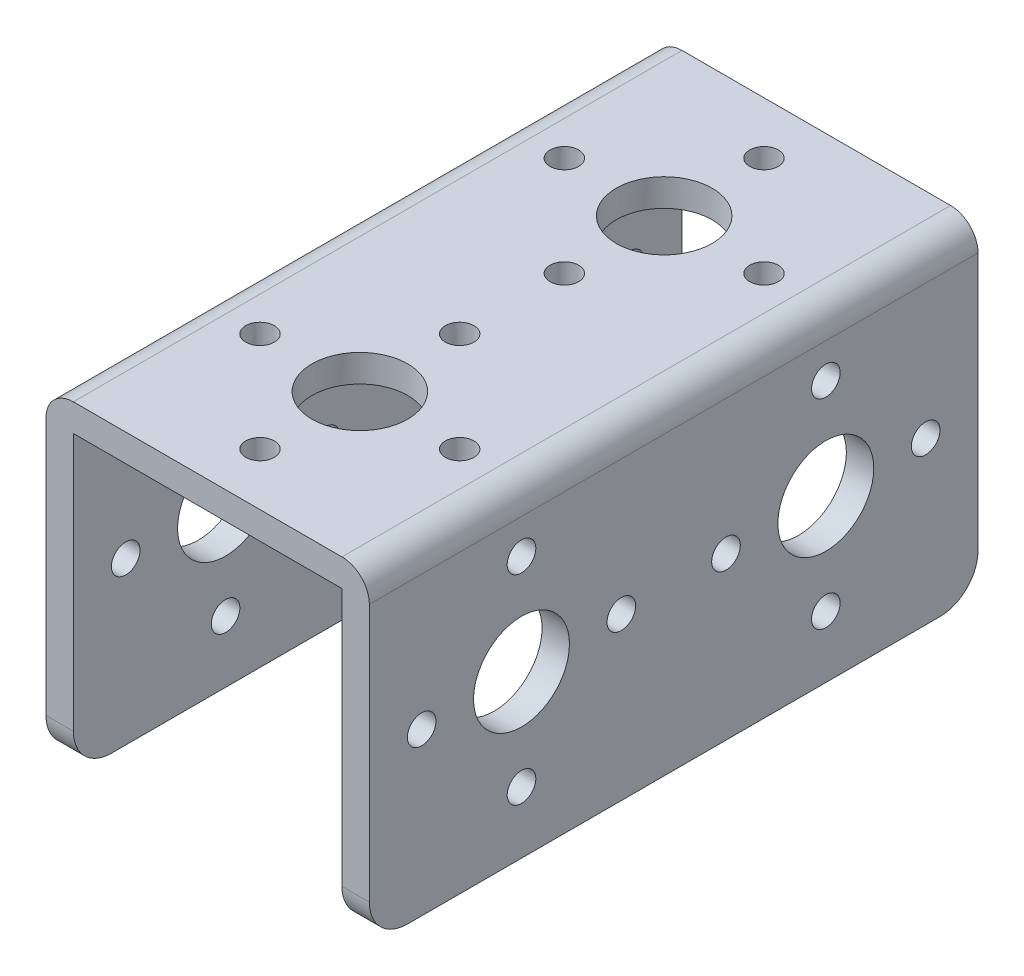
from build123d import *

# Parameters (mm, degrees)
EXTRUDE1_DEPTH      = 50.8
SKETCH2_R           = 4.0005
SKETCH2_R_2         = 1.1938
CUT_EXTRUDE1_DEPTH  = 47.312717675
SKETCH22_R          = 4.0005
SKETCH22_R_2        = 1.1938
CUT_EXTRUDE12_DEPTH = 48.801084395
LPATTERN1_COUNT     = 2
LPATTERN1_PITCH     = 25.4
FILLET1_R           = 2.286
FILLET2_R           = 3.175


with BuildPart() as part:
    # Sketch1 → Extrude1 (new body)
    with BuildSketch(Plane.XY):
        Polygon((11.20775, -26.9875), (11.20775, -2.286), (-11.20775, -2.286), (-11.20775, -26.9875), (-13.49375, -26.9875), (-13.49375, 0), (13.49375, 0), (13.49375, -26.9875), align=None)
    extrude(amount=-EXTRUDE1_DEPTH)

    # Sketch2 → Cut-Extrude1 (cut, through all)
    with BuildSketch(Plane(origin=(13.49375, -15.292465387, -16.409839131), x_dir=(0, 0, -1), z_dir=(1, 0, 0))):
        with Locations((-3.709839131, 1.792365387)):
            Circle(SKETCH2_R)
        with Locations((-3.709839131, 10.123565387)):
            Circle(SKETCH2_R_2)
        with Locations((4.621360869, 1.792365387)):
            Circle(SKETCH2_R_2)
        with Locations((-3.709839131, -6.538834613)):
            Circle(SKETCH2_R_2)
        with Locations((-12.041039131, 1.792365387)):
            Circle(SKETCH2_R_2)
    cut_extrude1 = extrude(amount=-CUT_EXTRUDE1_DEPTH, mode=Mode.SUBTRACT)

    # Sketch22 → Cut-Extrude12 (cut, through all)
    with BuildSketch(Plane(origin=(-3.640346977, 0, -15.26070859), x_dir=(-1, 0, 0), z_dir=(0, 1, 0))):
        with Locations(Location((-3.640346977, 2.56070859, 0), (0, 0, 90))):
            Circle(SKETCH22_R)
        with Locations(Location((-3.640346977, 10.89190859, 0), (0, 0, 90))):
            Circle(SKETCH22_R_2)
        with Locations(Location((4.690853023, 2.56070859, 0), (0, 0, 90))):
            Circle(SKETCH22_R_2)
        with Locations(Location((-3.640346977, -5.77049141, 0), (0, 0, 90))):
            Circle(SKETCH22_R_2)
        with Locations(Location((-11.971546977, 2.56070859, 0), (0, 0, 90))):
            Circle(SKETCH22_R_2)
    cut_extrude12 = extrude(amount=-CUT_EXTRUDE12_DEPTH, mode=Mode.SUBTRACT)

    # LPattern1: Cut-Extrude1, Cut-Extrude12 ×2
    with Locations(*[(0, 0, -i * LPATTERN1_PITCH) for i in range(1, LPATTERN1_COUNT)]):
        add(cut_extrude1, mode=Mode.SUBTRACT)
        add(cut_extrude12, mode=Mode.SUBTRACT)

    # Fillet1
    fillet1_edges = [part.edges().sort_by_distance(p)[0] for p in [
        (-13.49375, 0, -25.4),
        (13.49375, 0, -25.4),
    ]]
    fillet(fillet1_edges, radius=FILLET1_R)

    # Fillet2
    fillet2_edges = [part.edges().sort_by_distance(p)[0] for p in [
        (12.35075, -26.9875, -50.8),
        (-12.35075, -26.9875, -50.8),
        (12.35075, -26.9875, 0),
        (-12.35075, -26.9875, 0),
    ]]
    fillet(fillet2_edges, radius=FILLET2_R)


solid = part.part
